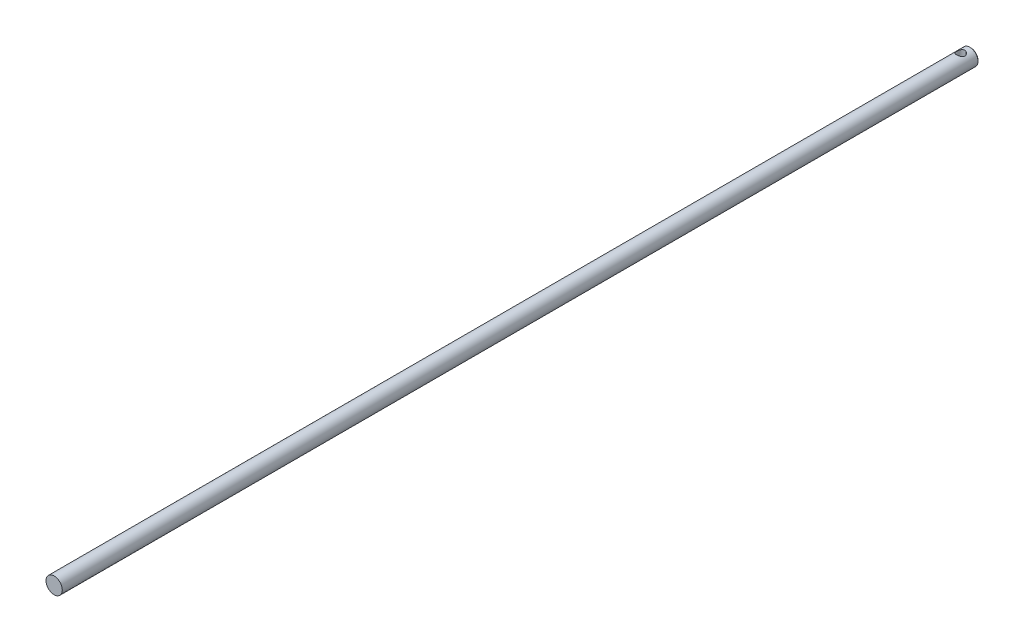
ISO-10303-21;
HEADER;
FILE_DESCRIPTION(('STEP AP214'),'2;1');
FILE_NAME('part.step','',(''),(''),'','','');
FILE_SCHEMA(('AUTOMOTIVE_DESIGN { 1 0 10303 214 1 1 1 1 }'));
ENDSEC;
DATA;
#1=APPLICATION_CONTEXT('core data for automotive mechanical design processes');
#2=APPLICATION_PROTOCOL_DEFINITION('international standard','automotive_design',2000,#1);
#3=PRODUCT_CONTEXT('',#1,'mechanical');
#4=PRODUCT('Part','Part','',(#3));
#5=PRODUCT_RELATED_PRODUCT_CATEGORY('part','',(#4));
#6=PRODUCT_DEFINITION_FORMATION('','',#4);
#7=PRODUCT_DEFINITION_CONTEXT('part definition',#1,'design');
#8=PRODUCT_DEFINITION('design','',#6,#7);
#9=PRODUCT_DEFINITION_SHAPE('','',#8);
#10=(LENGTH_UNIT() NAMED_UNIT(*) SI_UNIT(.MILLI.,.METRE.));
#11=(NAMED_UNIT(*) PLANE_ANGLE_UNIT() SI_UNIT($,.RADIAN.));
#12=(NAMED_UNIT(*) SI_UNIT($,.STERADIAN.) SOLID_ANGLE_UNIT());
#13=UNCERTAINTY_MEASURE_WITH_UNIT(LENGTH_MEASURE(1.E-05),#10,'distance_accuracy_value','');
#14=(GEOMETRIC_REPRESENTATION_CONTEXT(3) GLOBAL_UNCERTAINTY_ASSIGNED_CONTEXT((#13)) GLOBAL_UNIT_ASSIGNED_CONTEXT((#10,
#11,#12)) REPRESENTATION_CONTEXT('',''));
#15=CARTESIAN_POINT('',(0.,0.,0.));
#16=DIRECTION('',(0.,0.,1.));
#17=DIRECTION('',(1.,0.,0.));
#18=AXIS2_PLACEMENT_3D('',#15,#16,#17);
#19=CARTESIAN_POINT('',(0.,0.,450.));
#20=DIRECTION('',(0.,0.,-1.));
#21=DIRECTION('',(-1.,0.,0.));
#22=AXIS2_PLACEMENT_3D('',#19,#20,#21);
#23=CYLINDRICAL_SURFACE('',#22,4.);
#24=CARTESIAN_POINT('',(0.,0.,0.500000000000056));
#25=DIRECTION('',(0.,0.,1.));
#26=DIRECTION('',(1.,0.,0.));
#27=AXIS2_PLACEMENT_3D('',#24,#25,#26);
#28=CIRCLE('',#27,4.);
#29=CARTESIAN_POINT('',(4.,0.,0.500000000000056));
#30=VERTEX_POINT('',#29);
#31=EDGE_CURVE('E36',#30,#30,#28,.T.);
#32=ORIENTED_EDGE('',*,*,#31,.T.);
#33=EDGE_LOOP('',(#32));
#34=FACE_BOUND('',#33,.T.);
#35=CARTESIAN_POINT('',(0.,-4.,7.));
#36=CARTESIAN_POINT('',(0.105143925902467,-3.99999426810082,6.99999339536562));
#37=CARTESIAN_POINT('',(0.210413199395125,-3.99580982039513,6.99165985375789));
#38=CARTESIAN_POINT('',(0.417840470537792,-3.97948312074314,6.95869423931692));
#39=CARTESIAN_POINT('',(0.519992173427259,-3.96732575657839,6.93403121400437));
#40=CARTESIAN_POINT('',(0.717867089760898,-3.93632558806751,6.86961238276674));
#41=CARTESIAN_POINT('',(0.813613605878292,-3.91750878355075,6.82991523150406));
#42=CARTESIAN_POINT('',(0.996945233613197,-3.87491553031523,6.73685875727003));
#43=CARTESIAN_POINT('',(1.08453098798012,-3.85113947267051,6.68350051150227));
#44=CARTESIAN_POINT('',(1.25501563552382,-3.79912516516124,6.56096550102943));
#45=CARTESIAN_POINT('',(1.33731042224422,-3.77070398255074,6.49102704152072));
#46=CARTESIAN_POINT('',(1.48955888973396,-3.71319940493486,6.33895704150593));
#47=CARTESIAN_POINT('',(1.55950316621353,-3.68411552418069,6.25681629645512));
#48=CARTESIAN_POINT('',(1.69050400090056,-3.62597902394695,6.07503330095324));
#49=CARTESIAN_POINT('',(1.75045067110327,-3.59710373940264,5.97452780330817));
#50=CARTESIAN_POINT('',(1.85233645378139,-3.54571957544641,5.76326532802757));
#51=CARTESIAN_POINT('',(1.89428842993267,-3.52320615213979,5.6525157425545));
#52=CARTESIAN_POINT('',(1.95626488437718,-3.48915734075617,5.43066978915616));
#53=CARTESIAN_POINT('',(1.97745171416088,-3.47704543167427,5.31999109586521));
#54=CARTESIAN_POINT('',(2.00085398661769,-3.46363779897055,5.09604232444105));
#55=CARTESIAN_POINT('',(2.00308817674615,-3.46233138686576,4.98277491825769));
#56=CARTESIAN_POINT('',(1.98937457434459,-3.47021860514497,4.77142795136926));
#57=CARTESIAN_POINT('',(1.97556911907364,-3.47817527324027,4.6731519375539));
#58=CARTESIAN_POINT('',(1.93387969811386,-3.50152457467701,4.48055618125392));
#59=CARTESIAN_POINT('',(1.9059912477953,-3.51691957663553,4.38623770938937));
#60=CARTESIAN_POINT('',(1.83641956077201,-3.55374952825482,4.20154173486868));
#61=CARTESIAN_POINT('',(1.79443013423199,-3.57531681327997,4.11130720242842));
#62=CARTESIAN_POINT('',(1.698083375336,-3.62206808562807,3.93873141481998));
#63=CARTESIAN_POINT('',(1.64372048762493,-3.64725369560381,3.85639372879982));
#64=CARTESIAN_POINT('',(1.51613210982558,-3.70226315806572,3.69095749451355));
#65=CARTESIAN_POINT('',(1.44138891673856,-3.73227020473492,3.60908625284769));
#66=CARTESIAN_POINT('',(1.27911115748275,-3.79095246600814,3.4585291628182));
#67=CARTESIAN_POINT('',(1.19157051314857,-3.81962703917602,3.38984961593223));
#68=CARTESIAN_POINT('',(1.0010330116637,-3.87403974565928,3.26462867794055));
#69=CARTESIAN_POINT('',(0.897507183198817,-3.89957968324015,3.20879905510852));
#70=CARTESIAN_POINT('',(0.680932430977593,-3.94315762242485,3.11580594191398));
#71=CARTESIAN_POINT('',(0.567891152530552,-3.96120157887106,3.07862762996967));
#72=CARTESIAN_POINT('',(0.345532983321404,-3.98648667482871,3.02704919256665));
#73=CARTESIAN_POINT('',(0.236683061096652,-3.9944987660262,3.01101752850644));
#74=CARTESIAN_POINT('',(0.0175591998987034,-4.00146026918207,2.99707053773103));
#75=CARTESIAN_POINT('',(-0.0927140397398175,-4.00041397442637,2.99914662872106));
#76=CARTESIAN_POINT('',(-0.302465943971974,-3.9898238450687,3.02041337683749));
#77=CARTESIAN_POINT('',(-0.402118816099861,-3.98094491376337,3.03826506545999));
#78=CARTESIAN_POINT('',(-0.596813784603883,-3.9564434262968,3.08847614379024));
#79=CARTESIAN_POINT('',(-0.691855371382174,-3.94082012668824,3.12083713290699));
#80=CARTESIAN_POINT('',(-0.877777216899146,-3.90368502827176,3.19999693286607));
#81=CARTESIAN_POINT('',(-0.968460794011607,-3.88201763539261,3.24718210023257));
#82=CARTESIAN_POINT('',(-1.14092272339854,-3.83487948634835,3.35421507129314));
#83=CARTESIAN_POINT('',(-1.22269725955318,-3.80940711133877,3.41406826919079));
#84=CARTESIAN_POINT('',(-1.38353537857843,-3.75416442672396,3.55152085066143));
#85=CARTESIAN_POINT('',(-1.46154415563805,-3.72421769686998,3.6302857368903));
#86=CARTESIAN_POINT('',(-1.60371264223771,-3.6652478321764,3.79985030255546));
#87=CARTESIAN_POINT('',(-1.66786277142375,-3.63622534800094,3.89065823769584));
#88=CARTESIAN_POINT('',(-1.78341582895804,-3.58102384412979,4.08728730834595));
#89=CARTESIAN_POINT('',(-1.8340509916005,-3.55505059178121,4.19362253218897));
#90=CARTESIAN_POINT('',(-1.91616565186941,-3.51148144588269,4.41502013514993));
#91=CARTESIAN_POINT('',(-1.94766983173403,-3.493874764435,4.53007105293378));
#92=CARTESIAN_POINT('',(-1.98772337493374,-3.47123002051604,4.75382044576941));
#93=CARTESIAN_POINT('',(-1.9981859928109,-3.4651476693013,4.86206850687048));
#94=CARTESIAN_POINT('',(-2.0013783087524,-3.46330709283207,5.07889413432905));
#95=CARTESIAN_POINT('',(-1.99411569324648,-3.4675443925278,5.18747153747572));
#96=CARTESIAN_POINT('',(-1.96385225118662,-3.48475724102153,5.39096700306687));
#97=CARTESIAN_POINT('',(-1.94241662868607,-3.49686188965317,5.48620094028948));
#98=CARTESIAN_POINT('',(-1.88635071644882,-3.52742032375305,5.67161623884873));
#99=CARTESIAN_POINT('',(-1.85171618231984,-3.54587615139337,5.76179596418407));
#100=CARTESIAN_POINT('',(-1.76763149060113,-3.58857060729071,5.94124970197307));
#101=CARTESIAN_POINT('',(-1.7173422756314,-3.61311444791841,6.03005580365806));
#102=CARTESIAN_POINT('',(-1.60430194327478,-3.66470663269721,6.19854907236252));
#103=CARTESIAN_POINT('',(-1.54154434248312,-3.69175627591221,6.27823146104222));
#104=CARTESIAN_POINT('',(-1.39640665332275,-3.74924646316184,6.43628396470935));
#105=CARTESIAN_POINT('',(-1.31256884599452,-3.77969966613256,6.51331820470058));
#106=CARTESIAN_POINT('',(-1.13230961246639,-3.83755504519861,6.65252596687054));
#107=CARTESIAN_POINT('',(-1.03588144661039,-3.8649555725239,6.71469147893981));
#108=CARTESIAN_POINT('',(-0.83186319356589,-3.91396019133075,6.82247272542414));
#109=CARTESIAN_POINT('',(-0.72419900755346,-3.93552192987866,6.86796833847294));
#110=CARTESIAN_POINT('',(-0.501484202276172,-3.97002682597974,6.93961633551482));
#111=CARTESIAN_POINT('',(-0.386455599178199,-3.98299446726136,6.96582369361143));
#112=CARTESIAN_POINT('',(-0.22520389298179,-3.99390923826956,6.98779482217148));
#113=CARTESIAN_POINT('',(-0.180323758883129,-3.99618730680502,6.99236528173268));
#114=CARTESIAN_POINT('',(-0.090303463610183,-3.99923393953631,6.99846933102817));
#115=CARTESIAN_POINT('',(-0.0451632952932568,-4.00000246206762,7.00000283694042));
#116=CARTESIAN_POINT('',(0.,-4.,7.));
#117=B_SPLINE_CURVE_WITH_KNOTS('',3,(#35,#36,#37,#38,#39,#40,#41,#42,#43,#44,#45,#46,#47,#48,
#49,#50,#51,#52,#53,#54,#55,#56,#57,#58,#59,#60,#61,#62,#63,#64,#65,#66,#67,#68,#69,#70,#71,#72,
#73,#74,#75,#76,#77,#78,#79,#80,#81,#82,#83,#84,#85,#86,#87,#88,#89,#90,#91,#92,#93,#94,#95,#96,
#97,#98,#99,#100,#101,#102,#103,#104,#105,#106,#107,#108,#109,#110,#111,#112,#113,#114,#115,
#116),.UNSPECIFIED.,.T.,.F.,(4,2,2,2,2,2,2,2,2,2,2,2,2,2,2,2,2,2,2,2,2,2,2,2,2,2,2,2,2,2,2,2,2,
2,2,2,2,2,2,2,4),(0.,0.315248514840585,0.631096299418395,0.945724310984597,1.26032752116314,
1.59396351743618,1.92785247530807,2.28763452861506,2.64715895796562,2.98516024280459,
3.32282714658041,3.62011424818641,3.91749607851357,4.22180480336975,4.52625042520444,
4.86929882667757,5.21251069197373,5.57166044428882,5.93052433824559,6.25966580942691,
6.58865129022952,6.89213813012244,7.19565843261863,7.50785712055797,7.82018901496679,
8.16319221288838,8.50643177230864,8.86629364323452,9.22569023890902,9.55058615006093,
9.87534119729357,10.1691586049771,10.463070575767,10.7767291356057,11.0905512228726,
11.4425048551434,11.7946476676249,12.1492802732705,12.502898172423,12.6383056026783,
12.7737167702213),.UNSPECIFIED.);
#118=CARTESIAN_POINT('',(0.,-4.,7.));
#119=VERTEX_POINT('',#118);
#120=EDGE_CURVE('E40',#119,#119,#117,.T.);
#121=ORIENTED_EDGE('',*,*,#120,.T.);
#122=EDGE_LOOP('',(#121));
#123=FACE_BOUND('',#122,.T.);
#124=CARTESIAN_POINT('',(0.,4.,7.));
#125=CARTESIAN_POINT('',(-0.105143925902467,3.99999426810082,6.99999339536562));
#126=CARTESIAN_POINT('',(-0.210413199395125,3.99580982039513,6.99165985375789));
#127=CARTESIAN_POINT('',(-0.417840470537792,3.97948312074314,6.95869423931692));
#128=CARTESIAN_POINT('',(-0.519992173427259,3.96732575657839,6.93403121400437));
#129=CARTESIAN_POINT('',(-0.717867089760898,3.93632558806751,6.86961238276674));
#130=CARTESIAN_POINT('',(-0.813613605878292,3.91750878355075,6.82991523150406));
#131=CARTESIAN_POINT('',(-0.996945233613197,3.87491553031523,6.73685875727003));
#132=CARTESIAN_POINT('',(-1.08453098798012,3.85113947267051,6.68350051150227));
#133=CARTESIAN_POINT('',(-1.25501563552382,3.79912516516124,6.56096550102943));
#134=CARTESIAN_POINT('',(-1.33731042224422,3.77070398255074,6.49102704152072));
#135=CARTESIAN_POINT('',(-1.48955888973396,3.71319940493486,6.33895704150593));
#136=CARTESIAN_POINT('',(-1.55950316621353,3.68411552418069,6.25681629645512));
#137=CARTESIAN_POINT('',(-1.69050400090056,3.62597902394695,6.07503330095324));
#138=CARTESIAN_POINT('',(-1.75045067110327,3.59710373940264,5.97452780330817));
#139=CARTESIAN_POINT('',(-1.85233645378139,3.54571957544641,5.76326532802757));
#140=CARTESIAN_POINT('',(-1.89428842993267,3.52320615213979,5.6525157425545));
#141=CARTESIAN_POINT('',(-1.95626488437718,3.48915734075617,5.43066978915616));
#142=CARTESIAN_POINT('',(-1.97745171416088,3.47704543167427,5.31999109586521));
#143=CARTESIAN_POINT('',(-2.00085398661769,3.46363779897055,5.09604232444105));
#144=CARTESIAN_POINT('',(-2.00308817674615,3.46233138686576,4.98277491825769));
#145=CARTESIAN_POINT('',(-1.98937457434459,3.47021860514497,4.77142795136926));
#146=CARTESIAN_POINT('',(-1.97556911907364,3.47817527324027,4.6731519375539));
#147=CARTESIAN_POINT('',(-1.93387969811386,3.50152457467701,4.48055618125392));
#148=CARTESIAN_POINT('',(-1.9059912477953,3.51691957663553,4.38623770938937));
#149=CARTESIAN_POINT('',(-1.83641956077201,3.55374952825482,4.20154173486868));
#150=CARTESIAN_POINT('',(-1.79443013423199,3.57531681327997,4.11130720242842));
#151=CARTESIAN_POINT('',(-1.698083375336,3.62206808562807,3.93873141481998));
#152=CARTESIAN_POINT('',(-1.64372048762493,3.64725369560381,3.85639372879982));
#153=CARTESIAN_POINT('',(-1.51613210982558,3.70226315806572,3.69095749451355));
#154=CARTESIAN_POINT('',(-1.44138891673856,3.73227020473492,3.60908625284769));
#155=CARTESIAN_POINT('',(-1.27911115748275,3.79095246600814,3.4585291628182));
#156=CARTESIAN_POINT('',(-1.19157051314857,3.81962703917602,3.38984961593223));
#157=CARTESIAN_POINT('',(-1.0010330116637,3.87403974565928,3.26462867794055));
#158=CARTESIAN_POINT('',(-0.897507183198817,3.89957968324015,3.20879905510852));
#159=CARTESIAN_POINT('',(-0.680932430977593,3.94315762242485,3.11580594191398));
#160=CARTESIAN_POINT('',(-0.567891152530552,3.96120157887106,3.07862762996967));
#161=CARTESIAN_POINT('',(-0.345532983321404,3.98648667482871,3.02704919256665));
#162=CARTESIAN_POINT('',(-0.236683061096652,3.9944987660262,3.01101752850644));
#163=CARTESIAN_POINT('',(-0.0175591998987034,4.00146026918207,2.99707053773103));
#164=CARTESIAN_POINT('',(0.0927140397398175,4.00041397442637,2.99914662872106));
#165=CARTESIAN_POINT('',(0.302465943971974,3.9898238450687,3.02041337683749));
#166=CARTESIAN_POINT('',(0.402118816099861,3.98094491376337,3.03826506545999));
#167=CARTESIAN_POINT('',(0.596813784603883,3.9564434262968,3.08847614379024));
#168=CARTESIAN_POINT('',(0.691855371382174,3.94082012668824,3.12083713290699));
#169=CARTESIAN_POINT('',(0.877777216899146,3.90368502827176,3.19999693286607));
#170=CARTESIAN_POINT('',(0.968460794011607,3.88201763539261,3.24718210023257));
#171=CARTESIAN_POINT('',(1.14092272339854,3.83487948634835,3.35421507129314));
#172=CARTESIAN_POINT('',(1.22269725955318,3.80940711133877,3.41406826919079));
#173=CARTESIAN_POINT('',(1.38353537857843,3.75416442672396,3.55152085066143));
#174=CARTESIAN_POINT('',(1.46154415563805,3.72421769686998,3.6302857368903));
#175=CARTESIAN_POINT('',(1.60371264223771,3.6652478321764,3.79985030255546));
#176=CARTESIAN_POINT('',(1.66786277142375,3.63622534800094,3.89065823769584));
#177=CARTESIAN_POINT('',(1.78341582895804,3.58102384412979,4.08728730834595));
#178=CARTESIAN_POINT('',(1.8340509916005,3.55505059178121,4.19362253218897));
#179=CARTESIAN_POINT('',(1.91616565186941,3.51148144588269,4.41502013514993));
#180=CARTESIAN_POINT('',(1.94766983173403,3.493874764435,4.53007105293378));
#181=CARTESIAN_POINT('',(1.98772337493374,3.47123002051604,4.75382044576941));
#182=CARTESIAN_POINT('',(1.9981859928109,3.4651476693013,4.86206850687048));
#183=CARTESIAN_POINT('',(2.0013783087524,3.46330709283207,5.07889413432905));
#184=CARTESIAN_POINT('',(1.99411569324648,3.4675443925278,5.18747153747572));
#185=CARTESIAN_POINT('',(1.96385225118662,3.48475724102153,5.39096700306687));
#186=CARTESIAN_POINT('',(1.94241662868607,3.49686188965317,5.48620094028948));
#187=CARTESIAN_POINT('',(1.88635071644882,3.52742032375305,5.67161623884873));
#188=CARTESIAN_POINT('',(1.85171618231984,3.54587615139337,5.76179596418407));
#189=CARTESIAN_POINT('',(1.76763149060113,3.58857060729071,5.94124970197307));
#190=CARTESIAN_POINT('',(1.7173422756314,3.61311444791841,6.03005580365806));
#191=CARTESIAN_POINT('',(1.60430194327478,3.66470663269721,6.19854907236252));
#192=CARTESIAN_POINT('',(1.54154434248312,3.69175627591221,6.27823146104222));
#193=CARTESIAN_POINT('',(1.39640665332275,3.74924646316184,6.43628396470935));
#194=CARTESIAN_POINT('',(1.31256884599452,3.77969966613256,6.51331820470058));
#195=CARTESIAN_POINT('',(1.13230961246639,3.83755504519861,6.65252596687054));
#196=CARTESIAN_POINT('',(1.03588144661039,3.8649555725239,6.71469147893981));
#197=CARTESIAN_POINT('',(0.83186319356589,3.91396019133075,6.82247272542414));
#198=CARTESIAN_POINT('',(0.72419900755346,3.93552192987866,6.86796833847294));
#199=CARTESIAN_POINT('',(0.501484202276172,3.97002682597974,6.93961633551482));
#200=CARTESIAN_POINT('',(0.386455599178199,3.98299446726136,6.96582369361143));
#201=CARTESIAN_POINT('',(0.22520389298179,3.99390923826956,6.98779482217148));
#202=CARTESIAN_POINT('',(0.180323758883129,3.99618730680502,6.99236528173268));
#203=CARTESIAN_POINT('',(0.090303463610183,3.99923393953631,6.99846933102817));
#204=CARTESIAN_POINT('',(0.0451632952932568,4.00000246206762,7.00000283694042));
#205=CARTESIAN_POINT('',(0.,4.,7.));
#206=B_SPLINE_CURVE_WITH_KNOTS('',3,(#124,#125,#126,#127,#128,#129,#130,#131,#132,#133,#134,
#135,#136,#137,#138,#139,#140,#141,#142,#143,#144,#145,#146,#147,#148,#149,#150,#151,#152,#153,
#154,#155,#156,#157,#158,#159,#160,#161,#162,#163,#164,#165,#166,#167,#168,#169,#170,#171,#172,
#173,#174,#175,#176,#177,#178,#179,#180,#181,#182,#183,#184,#185,#186,#187,#188,#189,#190,#191,
#192,#193,#194,#195,#196,#197,#198,#199,#200,#201,#202,#203,#204,#205),.UNSPECIFIED.,.T.,.F.,(4,
2,2,2,2,2,2,2,2,2,2,2,2,2,2,2,2,2,2,2,2,2,2,2,2,2,2,2,2,2,2,2,2,2,2,2,2,2,2,2,4),(0.,
0.315248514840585,0.631096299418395,0.945724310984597,1.26032752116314,1.59396351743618,
1.92785247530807,2.28763452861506,2.64715895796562,2.98516024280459,3.32282714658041,
3.62011424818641,3.91749607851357,4.22180480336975,4.52625042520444,4.86929882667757,
5.21251069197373,5.57166044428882,5.93052433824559,6.25966580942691,6.58865129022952,
6.89213813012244,7.19565843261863,7.50785712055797,7.82018901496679,8.16319221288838,
8.50643177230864,8.86629364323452,9.22569023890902,9.55058615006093,9.87534119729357,
10.1691586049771,10.463070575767,10.7767291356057,11.0905512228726,11.4425048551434,
11.7946476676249,12.1492802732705,12.502898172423,12.6383056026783,12.7737167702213),.UNSPECIFIED.);
#207=CARTESIAN_POINT('',(0.,4.,7.));
#208=VERTEX_POINT('',#207);
#209=EDGE_CURVE('E50',#208,#208,#206,.T.);
#210=ORIENTED_EDGE('',*,*,#209,.T.);
#211=EDGE_LOOP('',(#210));
#212=FACE_BOUND('',#211,.T.);
#213=CARTESIAN_POINT('',(0.,0.,450.));
#214=DIRECTION('',(0.,0.,1.));
#215=DIRECTION('',(1.,0.,0.));
#216=AXIS2_PLACEMENT_3D('',#213,#214,#215);
#217=CIRCLE('',#216,4.);
#218=CARTESIAN_POINT('',(4.,0.,450.));
#219=VERTEX_POINT('',#218);
#220=EDGE_CURVE('E44',#219,#219,#217,.T.);
#221=ORIENTED_EDGE('',*,*,#220,.F.);
#222=EDGE_LOOP('',(#221));
#223=FACE_BOUND('',#222,.T.);
#224=ADVANCED_FACE('F29',(#34,#123,#212,#223),#23,.T.);
#225=CARTESIAN_POINT('',(0.,0.,450.));
#226=DIRECTION('',(0.,0.,1.));
#227=DIRECTION('',(1.,0.,0.));
#228=AXIS2_PLACEMENT_3D('',#225,#226,#227);
#229=PLANE('',#228);
#230=ORIENTED_EDGE('',*,*,#220,.T.);
#231=EDGE_LOOP('',(#230));
#232=FACE_BOUND('',#231,.T.);
#233=ADVANCED_FACE('F64',(#232),#229,.T.);
#234=CARTESIAN_POINT('',(0.,0.,0.));
#235=DIRECTION('',(0.,0.,1.));
#236=DIRECTION('',(1.,0.,0.));
#237=AXIS2_PLACEMENT_3D('',#234,#235,#236);
#238=PLANE('',#237);
#239=CARTESIAN_POINT('',(0.,0.,0.));
#240=DIRECTION('',(0.,0.,1.));
#241=DIRECTION('',(1.,0.,0.));
#242=AXIS2_PLACEMENT_3D('',#239,#240,#241);
#243=CIRCLE('',#242,3.49999999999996);
#244=CARTESIAN_POINT('',(3.49999999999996,0.,0.));
#245=VERTEX_POINT('',#244);
#246=EDGE_CURVE('E10',#245,#245,#243,.F.);
#247=ORIENTED_EDGE('',*,*,#246,.T.);
#248=EDGE_LOOP('',(#247));
#249=FACE_BOUND('',#248,.T.);
#250=ADVANCED_FACE('F60',(#249),#238,.F.);
#251=CARTESIAN_POINT('',(0.,-4.,5.));
#252=DIRECTION('',(0.,1.,0.));
#253=DIRECTION('',(0.,0.,1.));
#254=AXIS2_PLACEMENT_3D('',#251,#252,#253);
#255=CYLINDRICAL_SURFACE('',#254,2.);
#256=ORIENTED_EDGE('',*,*,#209,.F.);
#257=EDGE_LOOP('',(#256));
#258=FACE_BOUND('',#257,.T.);
#259=ORIENTED_EDGE('',*,*,#120,.F.);
#260=EDGE_LOOP('',(#259));
#261=FACE_BOUND('',#260,.T.);
#262=ADVANCED_FACE('F54',(#258,#261),#255,.F.);
#263=CARTESIAN_POINT('',(0.,0.,0.500000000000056));
#264=DIRECTION('',(0.,0.,1.));
#265=DIRECTION('',(1.,0.,0.));
#266=AXIS2_PLACEMENT_3D('',#263,#264,#265);
#267=CONICAL_SURFACE('',#266,4.,0.785398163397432);
#268=ORIENTED_EDGE('',*,*,#246,.F.);
#269=EDGE_LOOP('',(#268));
#270=FACE_BOUND('',#269,.T.);
#271=ORIENTED_EDGE('',*,*,#31,.F.);
#272=EDGE_LOOP('',(#271));
#273=FACE_BOUND('',#272,.T.);
#274=ADVANCED_FACE('F59',(#270,#273),#267,.T.);
#275=CLOSED_SHELL('',(#224,#233,#250,#262,#274));
#276=MANIFOLD_SOLID_BREP('B2',#275);
#277=ADVANCED_BREP_SHAPE_REPRESENTATION('',(#18,#276),#14);
#278=SHAPE_DEFINITION_REPRESENTATION(#9,#277);
ENDSEC;
END-ISO-10303-21;
